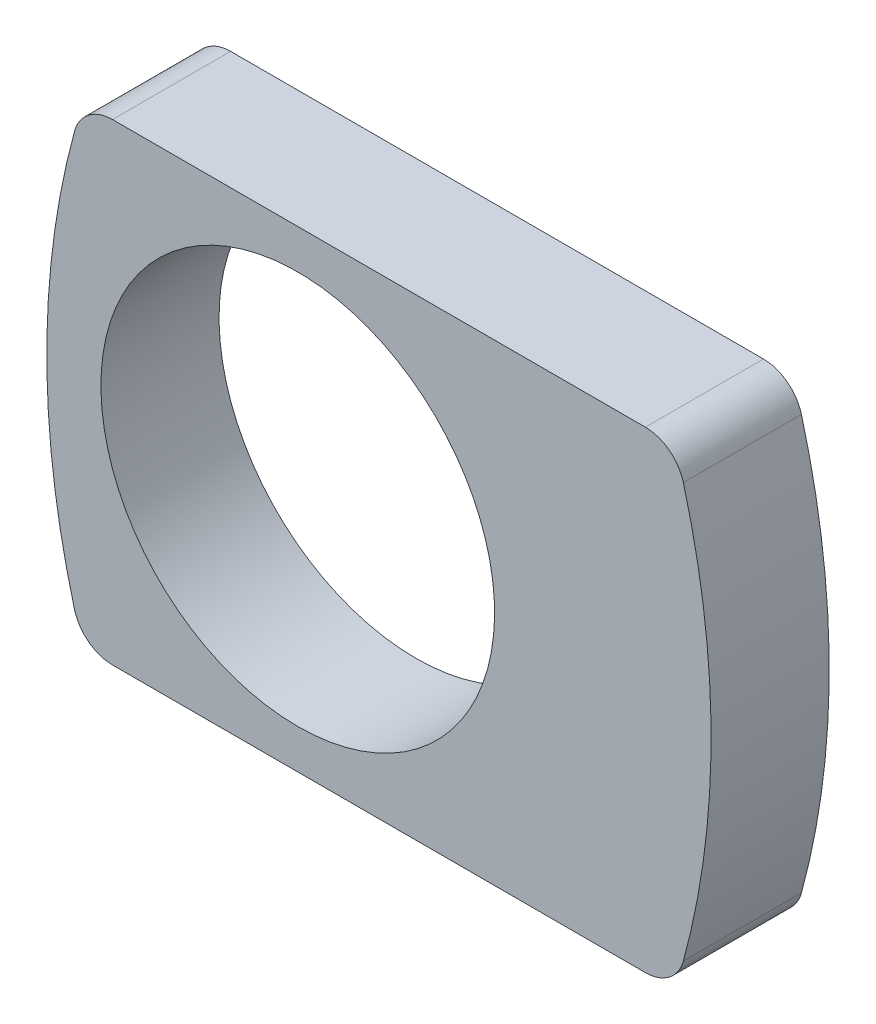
ISO-10303-21;
HEADER;
FILE_DESCRIPTION(('STEP AP214'),'2;1');
FILE_NAME('part.step','',(''),(''),'','','');
FILE_SCHEMA(('AUTOMOTIVE_DESIGN { 1 0 10303 214 1 1 1 1 }'));
ENDSEC;
DATA;
#1=APPLICATION_CONTEXT('core data for automotive mechanical design processes');
#2=APPLICATION_PROTOCOL_DEFINITION('international standard','automotive_design',2000,#1);
#3=PRODUCT_CONTEXT('',#1,'mechanical');
#4=PRODUCT('Part','Part','',(#3));
#5=PRODUCT_RELATED_PRODUCT_CATEGORY('part','',(#4));
#6=PRODUCT_DEFINITION_FORMATION('','',#4);
#7=PRODUCT_DEFINITION_CONTEXT('part definition',#1,'design');
#8=PRODUCT_DEFINITION('design','',#6,#7);
#9=PRODUCT_DEFINITION_SHAPE('','',#8);
#10=(LENGTH_UNIT() NAMED_UNIT(*) SI_UNIT(.MILLI.,.METRE.));
#11=(NAMED_UNIT(*) PLANE_ANGLE_UNIT() SI_UNIT($,.RADIAN.));
#12=(NAMED_UNIT(*) SI_UNIT($,.STERADIAN.) SOLID_ANGLE_UNIT());
#13=UNCERTAINTY_MEASURE_WITH_UNIT(LENGTH_MEASURE(1.E-05),#10,'distance_accuracy_value','');
#14=(GEOMETRIC_REPRESENTATION_CONTEXT(3) GLOBAL_UNCERTAINTY_ASSIGNED_CONTEXT((#13)) GLOBAL_UNIT_ASSIGNED_CONTEXT((#10,
#11,#12)) REPRESENTATION_CONTEXT('',''));
#15=CARTESIAN_POINT('',(0.,0.,0.));
#16=DIRECTION('',(0.,0.,1.));
#17=DIRECTION('',(1.,0.,0.));
#18=AXIS2_PLACEMENT_3D('',#15,#16,#17);
#19=CARTESIAN_POINT('',(-18.821211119,-24.,0.));
#20=DIRECTION('',(0.,1.,0.));
#21=DIRECTION('',(0.,0.,1.));
#22=AXIS2_PLACEMENT_3D('',#19,#20,#21);
#23=PLANE('',#22);
#24=DIRECTION('',(0.,0.,-1.));
#25=VECTOR('',#24,1.);
#26=CARTESIAN_POINT('',(35.3212111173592,-24.,14.474633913));
#27=LINE('',#26,#25);
#28=CARTESIAN_POINT('',(35.3212111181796,-24.,12.));
#29=VERTEX_POINT('',#28);
#30=CARTESIAN_POINT('',(35.3212111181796,-24.,0.));
#31=VERTEX_POINT('',#30);
#32=EDGE_CURVE('E74',#29,#31,#27,.T.);
#33=ORIENTED_EDGE('',*,*,#32,.F.);
#34=DIRECTION('',(-1.,0.,0.));
#35=VECTOR('',#34,1.);
#36=CARTESIAN_POINT('',(-18.821211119,-24.,12.));
#37=LINE('',#36,#35);
#38=CARTESIAN_POINT('',(-18.8212111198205,-24.,12.));
#39=VERTEX_POINT('',#38);
#40=EDGE_CURVE('E106',#29,#39,#37,.T.);
#41=ORIENTED_EDGE('',*,*,#40,.T.);
#42=DIRECTION('',(0.,0.,1.));
#43=VECTOR('',#42,1.);
#44=CARTESIAN_POINT('',(-18.8212111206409,-24.,14.75));
#45=LINE('',#44,#43);
#46=CARTESIAN_POINT('',(-18.8212111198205,-24.,0.));
#47=VERTEX_POINT('',#46);
#48=EDGE_CURVE('E114',#47,#39,#45,.T.);
#49=ORIENTED_EDGE('',*,*,#48,.F.);
#50=DIRECTION('',(1.,0.,0.));
#51=VECTOR('',#50,1.);
#52=CARTESIAN_POINT('',(8.25,-24.,0.));
#53=LINE('',#52,#51);
#54=EDGE_CURVE('E83',#47,#31,#53,.T.);
#55=ORIENTED_EDGE('',*,*,#54,.T.);
#56=EDGE_LOOP('',(#33,#41,#49,#55));
#57=FACE_BOUND('',#56,.T.);
#58=ADVANCED_FACE('F14',(#57),#23,.F.);
#59=CARTESIAN_POINT('',(35.321211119,-20.,28.949267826));
#60=DIRECTION('',(0.,0.,-1.));
#61=DIRECTION('',(1.,0.,0.));
#62=AXIS2_PLACEMENT_3D('',#59,#60,#61);
#63=CYLINDRICAL_SURFACE('',#62,4.);
#64=DIRECTION('',(0.,0.,-1.));
#65=VECTOR('',#64,1.);
#66=CARTESIAN_POINT('',(39.1802222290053,-21.0526315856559,10.205426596));
#67=LINE('',#66,#65);
#68=CARTESIAN_POINT('',(39.1802222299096,-21.0526315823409,12.));
#69=VERTEX_POINT('',#68);
#70=CARTESIAN_POINT('',(39.180222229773,-21.0526315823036,0.));
#71=VERTEX_POINT('',#70);
#72=EDGE_CURVE('E61',#69,#71,#67,.T.);
#73=ORIENTED_EDGE('',*,*,#72,.F.);
#74=CARTESIAN_POINT('',(35.321211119,-20.,12.));
#75=DIRECTION('',(0.,0.,-1.));
#76=DIRECTION('',(1.,0.,0.));
#77=AXIS2_PLACEMENT_3D('',#74,#75,#76);
#78=CIRCLE('',#77,4.);
#79=EDGE_CURVE('E125',#69,#29,#78,.T.);
#80=ORIENTED_EDGE('',*,*,#79,.T.);
#81=ORIENTED_EDGE('',*,*,#32,.T.);
#82=CARTESIAN_POINT('',(35.321211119,-20.,0.));
#83=DIRECTION('',(0.,0.,-1.));
#84=DIRECTION('',(1.,0.,0.));
#85=AXIS2_PLACEMENT_3D('',#82,#83,#84);
#86=CIRCLE('',#85,4.);
#87=EDGE_CURVE('E77',#31,#71,#86,.F.);
#88=ORIENTED_EDGE('',*,*,#87,.T.);
#89=EDGE_LOOP('',(#73,#80,#81,#88));
#90=FACE_BOUND('',#89,.T.);
#91=ADVANCED_FACE('F78',(#90),#63,.T.);
#92=CARTESIAN_POINT('',(-38.,0.,20.410853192));
#93=DIRECTION('',(0.,0.,-1.));
#94=DIRECTION('',(0.,1.,0.));
#95=AXIS2_PLACEMENT_3D('',#92,#93,#94);
#96=CYLINDRICAL_SURFACE('',#95,80.);
#97=DIRECTION('',(0.,0.,-1.));
#98=VECTOR('',#97,1.);
#99=CARTESIAN_POINT('',(39.1802222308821,21.0526315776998,14.474633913));
#100=LINE('',#99,#98);
#101=CARTESIAN_POINT('',(39.1802222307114,21.0526315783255,12.));
#102=VERTEX_POINT('',#101);
#103=CARTESIAN_POINT('',(39.180222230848,21.0526315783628,0.));
#104=VERTEX_POINT('',#103);
#105=EDGE_CURVE('E73',#102,#104,#100,.T.);
#106=ORIENTED_EDGE('',*,*,#105,.F.);
#107=CARTESIAN_POINT('',(-38.,0.,12.));
#108=DIRECTION('',(0.,0.,-1.));
#109=DIRECTION('',(1.,0.,0.));
#110=AXIS2_PLACEMENT_3D('',#107,#108,#109);
#111=CIRCLE('',#110,80.);
#112=EDGE_CURVE('E70',#102,#69,#111,.T.);
#113=ORIENTED_EDGE('',*,*,#112,.T.);
#114=ORIENTED_EDGE('',*,*,#72,.T.);
#115=CARTESIAN_POINT('',(-38.,0.,0.));
#116=DIRECTION('',(0.,0.,-1.));
#117=DIRECTION('',(0.,1.,0.));
#118=AXIS2_PLACEMENT_3D('',#115,#116,#117);
#119=CIRCLE('',#118,80.);
#120=EDGE_CURVE('E66',#71,#104,#119,.F.);
#121=ORIENTED_EDGE('',*,*,#120,.T.);
#122=EDGE_LOOP('',(#106,#113,#114,#121));
#123=FACE_BOUND('',#122,.T.);
#124=ADVANCED_FACE('F64',(#123),#96,.T.);
#125=CARTESIAN_POINT('',(35.321211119,20.,28.949267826));
#126=DIRECTION('',(0.,0.,-1.));
#127=DIRECTION('',(1.,0.,0.));
#128=AXIS2_PLACEMENT_3D('',#125,#126,#127);
#129=CYLINDRICAL_SURFACE('',#128,4.);
#130=DIRECTION('',(0.,0.,1.));
#131=VECTOR('',#130,1.);
#132=CARTESIAN_POINT('',(35.321211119,24.,14.75));
#133=LINE('',#132,#131);
#134=CARTESIAN_POINT('',(35.321211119,24.,0.));
#135=VERTEX_POINT('',#134);
#136=CARTESIAN_POINT('',(35.32121112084,24.,12.));
#137=VERTEX_POINT('',#136);
#138=EDGE_CURVE('E109',#135,#137,#133,.T.);
#139=ORIENTED_EDGE('',*,*,#138,.T.);
#140=CARTESIAN_POINT('',(35.321211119,20.,12.));
#141=DIRECTION('',(0.,0.,-1.));
#142=DIRECTION('',(1.,0.,0.));
#143=AXIS2_PLACEMENT_3D('',#140,#141,#142);
#144=CIRCLE('',#143,4.);
#145=EDGE_CURVE('E128',#137,#102,#144,.T.);
#146=ORIENTED_EDGE('',*,*,#145,.T.);
#147=ORIENTED_EDGE('',*,*,#105,.T.);
#148=CARTESIAN_POINT('',(35.321211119,20.,0.));
#149=DIRECTION('',(0.,0.,-1.));
#150=DIRECTION('',(1.,0.,0.));
#151=AXIS2_PLACEMENT_3D('',#148,#149,#150);
#152=CIRCLE('',#151,4.);
#153=EDGE_CURVE('E86',#104,#135,#152,.F.);
#154=ORIENTED_EDGE('',*,*,#153,.T.);
#155=EDGE_LOOP('',(#139,#146,#147,#154));
#156=FACE_BOUND('',#155,.T.);
#157=ADVANCED_FACE('F174',(#156),#129,.T.);
#158=CARTESIAN_POINT('',(-18.821211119,24.,29.5));
#159=DIRECTION('',(0.,-1.,0.));
#160=DIRECTION('',(0.,0.,-1.));
#161=AXIS2_PLACEMENT_3D('',#158,#159,#160);
#162=PLANE('',#161);
#163=DIRECTION('',(0.,0.,-1.));
#164=VECTOR('',#163,1.);
#165=CARTESIAN_POINT('',(-18.8212111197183,24.,14.75));
#166=LINE('',#165,#164);
#167=CARTESIAN_POINT('',(-18.8212111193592,24.,12.));
#168=VERTEX_POINT('',#167);
#169=CARTESIAN_POINT('',(-18.8212111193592,24.,0.));
#170=VERTEX_POINT('',#169);
#171=EDGE_CURVE('E110',#168,#170,#166,.T.);
#172=ORIENTED_EDGE('',*,*,#171,.F.);
#173=DIRECTION('',(1.,0.,0.));
#174=VECTOR('',#173,1.);
#175=CARTESIAN_POINT('',(-18.821211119,24.,12.));
#176=LINE('',#175,#174);
#177=EDGE_CURVE('E131',#168,#137,#176,.T.);
#178=ORIENTED_EDGE('',*,*,#177,.T.);
#179=ORIENTED_EDGE('',*,*,#138,.F.);
#180=DIRECTION('',(-1.,0.,0.));
#181=VECTOR('',#180,1.);
#182=CARTESIAN_POINT('',(8.25,24.,0.));
#183=LINE('',#182,#181);
#184=EDGE_CURVE('E88',#135,#170,#183,.T.);
#185=ORIENTED_EDGE('',*,*,#184,.T.);
#186=EDGE_LOOP('',(#172,#178,#179,#185));
#187=FACE_BOUND('',#186,.T.);
#188=ADVANCED_FACE('F173',(#187),#162,.F.);
#189=CARTESIAN_POINT('',(-18.821211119,20.,29.5));
#190=DIRECTION('',(0.,0.,-1.));
#191=DIRECTION('',(1.,0.,0.));
#192=AXIS2_PLACEMENT_3D('',#189,#190,#191);
#193=CYLINDRICAL_SURFACE('',#192,4.);
#194=DIRECTION('',(0.,0.,-1.));
#195=VECTOR('',#194,1.);
#196=CARTESIAN_POINT('',(-22.6802222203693,21.0526316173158,14.7489259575));
#197=LINE('',#196,#195);
#198=CARTESIAN_POINT('',(-22.6802222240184,21.0526316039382,12.));
#199=VERTEX_POINT('',#198);
#200=CARTESIAN_POINT('',(-22.6802222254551,21.0526315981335,0.));
#201=VERTEX_POINT('',#200);
#202=EDGE_CURVE('E112',#199,#201,#197,.T.);
#203=ORIENTED_EDGE('',*,*,#202,.F.);
#204=CARTESIAN_POINT('',(-18.821211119,20.,12.));
#205=DIRECTION('',(0.,0.,-1.));
#206=DIRECTION('',(1.,0.,0.));
#207=AXIS2_PLACEMENT_3D('',#204,#205,#206);
#208=CIRCLE('',#207,4.);
#209=EDGE_CURVE('E134',#199,#168,#208,.T.);
#210=ORIENTED_EDGE('',*,*,#209,.T.);
#211=ORIENTED_EDGE('',*,*,#171,.T.);
#212=CARTESIAN_POINT('',(-18.821211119,20.,0.));
#213=DIRECTION('',(0.,0.,-1.));
#214=DIRECTION('',(1.,0.,0.));
#215=AXIS2_PLACEMENT_3D('',#212,#213,#214);
#216=CIRCLE('',#215,4.);
#217=EDGE_CURVE('E91',#170,#201,#216,.F.);
#218=ORIENTED_EDGE('',*,*,#217,.T.);
#219=EDGE_LOOP('',(#203,#210,#211,#218));
#220=FACE_BOUND('',#219,.T.);
#221=ADVANCED_FACE('F183',(#220),#193,.T.);
#222=CARTESIAN_POINT('',(54.5,0.,29.497851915));
#223=DIRECTION('',(0.,0.,-1.));
#224=DIRECTION('',(0.,1.,0.));
#225=AXIS2_PLACEMENT_3D('',#222,#223,#224);
#226=CYLINDRICAL_SURFACE('',#225,80.);
#227=DIRECTION('',(0.,0.,-1.));
#228=VECTOR('',#227,1.);
#229=CARTESIAN_POINT('',(-22.6802222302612,-21.0526315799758,14.75));
#230=LINE('',#229,#228);
#231=CARTESIAN_POINT('',(-22.6802222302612,-21.0526315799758,12.));
#232=VERTEX_POINT('',#231);
#233=CARTESIAN_POINT('',(-22.6802222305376,-21.0526315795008,0.));
#234=VERTEX_POINT('',#233);
#235=EDGE_CURVE('E36',#232,#234,#230,.T.);
#236=ORIENTED_EDGE('',*,*,#235,.F.);
#237=CARTESIAN_POINT('',(54.5,0.,12.));
#238=DIRECTION('',(0.,0.,-1.));
#239=DIRECTION('',(1.,0.,0.));
#240=AXIS2_PLACEMENT_3D('',#237,#238,#239);
#241=CIRCLE('',#240,80.);
#242=EDGE_CURVE('E29',#232,#199,#241,.T.);
#243=ORIENTED_EDGE('',*,*,#242,.T.);
#244=ORIENTED_EDGE('',*,*,#202,.T.);
#245=CARTESIAN_POINT('',(54.5,0.,0.));
#246=DIRECTION('',(0.,0.,-1.));
#247=DIRECTION('',(0.,1.,0.));
#248=AXIS2_PLACEMENT_3D('',#245,#246,#247);
#249=CIRCLE('',#248,80.);
#250=EDGE_CURVE('E94',#201,#234,#249,.F.);
#251=ORIENTED_EDGE('',*,*,#250,.T.);
#252=EDGE_LOOP('',(#236,#243,#244,#251));
#253=FACE_BOUND('',#252,.T.);
#254=ADVANCED_FACE('F214',(#253),#226,.T.);
#255=CARTESIAN_POINT('',(-18.821211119,-20.,29.5));
#256=DIRECTION('',(0.,0.,-1.));
#257=DIRECTION('',(1.,0.,0.));
#258=AXIS2_PLACEMENT_3D('',#255,#256,#257);
#259=CYLINDRICAL_SURFACE('',#258,4.);
#260=ORIENTED_EDGE('',*,*,#48,.T.);
#261=CARTESIAN_POINT('',(-18.821211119,-20.,12.));
#262=DIRECTION('',(0.,0.,-1.));
#263=DIRECTION('',(1.,0.,0.));
#264=AXIS2_PLACEMENT_3D('',#261,#262,#263);
#265=CIRCLE('',#264,4.);
#266=EDGE_CURVE('E9',#39,#232,#265,.T.);
#267=ORIENTED_EDGE('',*,*,#266,.T.);
#268=ORIENTED_EDGE('',*,*,#235,.T.);
#269=CARTESIAN_POINT('',(-18.821211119,-20.,0.));
#270=DIRECTION('',(0.,0.,-1.));
#271=DIRECTION('',(1.,0.,0.));
#272=AXIS2_PLACEMENT_3D('',#269,#270,#271);
#273=CIRCLE('',#272,4.);
#274=EDGE_CURVE('E96',#234,#47,#273,.F.);
#275=ORIENTED_EDGE('',*,*,#274,.T.);
#276=EDGE_LOOP('',(#260,#267,#268,#275));
#277=FACE_BOUND('',#276,.T.);
#278=ADVANCED_FACE('F159',(#277),#259,.T.);
#279=CARTESIAN_POINT('',(0.,0.,0.));
#280=DIRECTION('',(0.,0.,1.));
#281=DIRECTION('',(0.,-1.,0.));
#282=AXIS2_PLACEMENT_3D('',#279,#280,#281);
#283=CYLINDRICAL_SURFACE('',#282,20.);
#284=CARTESIAN_POINT('',(0.,0.,0.));
#285=DIRECTION('',(0.,0.,1.));
#286=DIRECTION('',(0.,-1.,0.));
#287=AXIS2_PLACEMENT_3D('',#284,#285,#286);
#288=CIRCLE('',#287,20.);
#289=CARTESIAN_POINT('',(0.,-20.,0.));
#290=VERTEX_POINT('',#289);
#291=EDGE_CURVE('E98',#290,#290,#288,.F.);
#292=ORIENTED_EDGE('',*,*,#291,.T.);
#293=EDGE_LOOP('',(#292));
#294=FACE_BOUND('',#293,.T.);
#295=CARTESIAN_POINT('',(0.,0.,12.));
#296=DIRECTION('',(0.,0.,1.));
#297=DIRECTION('',(0.,-1.,0.));
#298=AXIS2_PLACEMENT_3D('',#295,#296,#297);
#299=CIRCLE('',#298,20.);
#300=CARTESIAN_POINT('',(0.,-20.,12.));
#301=VERTEX_POINT('',#300);
#302=EDGE_CURVE('E138',#301,#301,#299,.T.);
#303=ORIENTED_EDGE('',*,*,#302,.T.);
#304=EDGE_LOOP('',(#303));
#305=FACE_BOUND('',#304,.T.);
#306=ADVANCED_FACE('F142',(#294,#305),#283,.F.);
#307=CARTESIAN_POINT('',(26.953553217,-3.036,-6.));
#308=DIRECTION('',(0.,0.,-1.));
#309=DIRECTION('',(0.,1.,0.));
#310=AXIS2_PLACEMENT_3D('',#307,#308,#309);
#311=PLANE('',#310);
#312=CARTESIAN_POINT('',(30.,0.,-6.));
#313=DIRECTION('',(0.,0.,1.));
#314=DIRECTION('',(0.,-1.,0.));
#315=AXIS2_PLACEMENT_3D('',#312,#313,#314);
#316=CIRCLE('',#315,3.);
#317=CARTESIAN_POINT('',(30.,-3.,-6.));
#318=VERTEX_POINT('',#317);
#319=EDGE_CURVE('E101',#318,#318,#316,.T.);
#320=ORIENTED_EDGE('',*,*,#319,.F.);
#321=EDGE_LOOP('',(#320));
#322=FACE_BOUND('',#321,.T.);
#323=ADVANCED_FACE('F195',(#322),#311,.T.);
#324=CARTESIAN_POINT('',(-26.611845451,24.,0.));
#325=DIRECTION('',(0.,0.,1.));
#326=DIRECTION('',(0.,-1.,0.));
#327=AXIS2_PLACEMENT_3D('',#324,#325,#326);
#328=PLANE('',#327);
#329=CARTESIAN_POINT('',(30.,0.,0.));
#330=DIRECTION('',(0.,0.,1.));
#331=DIRECTION('',(0.,-1.,0.));
#332=AXIS2_PLACEMENT_3D('',#329,#330,#331);
#333=CIRCLE('',#332,3.);
#334=CARTESIAN_POINT('',(30.,-3.,0.));
#335=VERTEX_POINT('',#334);
#336=EDGE_CURVE('E22',#335,#335,#333,.F.);
#337=ORIENTED_EDGE('',*,*,#336,.F.);
#338=EDGE_LOOP('',(#337));
#339=FACE_BOUND('',#338,.T.);
#340=ORIENTED_EDGE('',*,*,#291,.F.);
#341=EDGE_LOOP('',(#340));
#342=FACE_BOUND('',#341,.T.);
#343=ORIENTED_EDGE('',*,*,#250,.F.);
#344=ORIENTED_EDGE('',*,*,#217,.F.);
#345=ORIENTED_EDGE('',*,*,#184,.F.);
#346=ORIENTED_EDGE('',*,*,#153,.F.);
#347=ORIENTED_EDGE('',*,*,#120,.F.);
#348=ORIENTED_EDGE('',*,*,#87,.F.);
#349=ORIENTED_EDGE('',*,*,#54,.F.);
#350=ORIENTED_EDGE('',*,*,#274,.F.);
#351=EDGE_LOOP('',(#343,#344,#345,#346,#347,#348,#349,#350));
#352=FACE_BOUND('',#351,.T.);
#353=ADVANCED_FACE('F16',(#339,#342,#352),#328,.F.);
#354=CARTESIAN_POINT('',(30.,0.,-6.));
#355=DIRECTION('',(0.,0.,1.));
#356=DIRECTION('',(0.,-1.,0.));
#357=AXIS2_PLACEMENT_3D('',#354,#355,#356);
#358=CYLINDRICAL_SURFACE('',#357,3.);
#359=ORIENTED_EDGE('',*,*,#336,.T.);
#360=EDGE_LOOP('',(#359));
#361=FACE_BOUND('',#360,.T.);
#362=ORIENTED_EDGE('',*,*,#319,.T.);
#363=EDGE_LOOP('',(#362));
#364=FACE_BOUND('',#363,.T.);
#365=ADVANCED_FACE('F146',(#361,#364),#358,.T.);
#366=CARTESIAN_POINT('',(91.5625313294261,45.,12.));
#367=DIRECTION('',(0.,0.,-1.));
#368=DIRECTION('',(1.,0.,0.));
#369=AXIS2_PLACEMENT_3D('',#366,#367,#368);
#370=PLANE('',#369);
#371=ORIENTED_EDGE('',*,*,#302,.F.);
#372=EDGE_LOOP('',(#371));
#373=FACE_BOUND('',#372,.T.);
#374=ORIENTED_EDGE('',*,*,#79,.F.);
#375=ORIENTED_EDGE('',*,*,#112,.F.);
#376=ORIENTED_EDGE('',*,*,#145,.F.);
#377=ORIENTED_EDGE('',*,*,#177,.F.);
#378=ORIENTED_EDGE('',*,*,#209,.F.);
#379=ORIENTED_EDGE('',*,*,#242,.F.);
#380=ORIENTED_EDGE('',*,*,#266,.F.);
#381=ORIENTED_EDGE('',*,*,#40,.F.);
#382=EDGE_LOOP('',(#374,#375,#376,#377,#378,#379,#380,#381));
#383=FACE_BOUND('',#382,.T.);
#384=ADVANCED_FACE('F144',(#373,#383),#370,.F.);
#385=CLOSED_SHELL('',(#58,#91,#124,#157,#188,#221,#254,#278,#306,#323,#353,#365,#384));
#386=MANIFOLD_SOLID_BREP('B1',#385);
#387=ADVANCED_BREP_SHAPE_REPRESENTATION('',(#18,#386),#14);
#388=SHAPE_DEFINITION_REPRESENTATION(#9,#387);
ENDSEC;
END-ISO-10303-21;
